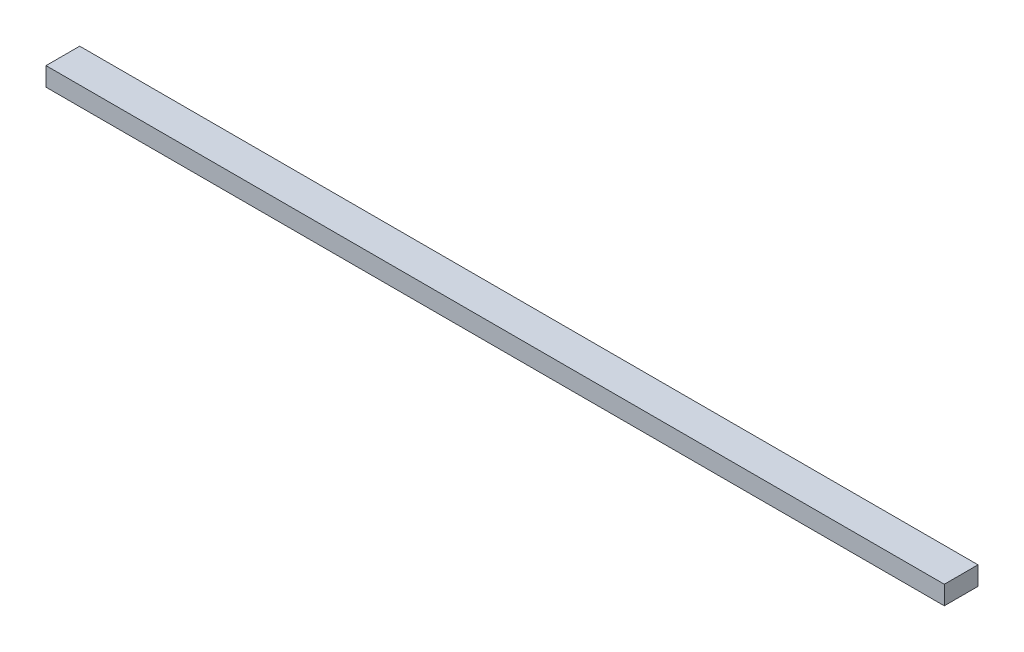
ISO-10303-21;
HEADER;
FILE_DESCRIPTION(('STEP AP214'),'2;1');
FILE_NAME('part.step','',(''),(''),'','','');
FILE_SCHEMA(('AUTOMOTIVE_DESIGN { 1 0 10303 214 1 1 1 1 }'));
ENDSEC;
DATA;
#1=APPLICATION_CONTEXT('core data for automotive mechanical design processes');
#2=APPLICATION_PROTOCOL_DEFINITION('international standard','automotive_design',2000,#1);
#3=PRODUCT_CONTEXT('',#1,'mechanical');
#4=PRODUCT('Part','Part','',(#3));
#5=PRODUCT_RELATED_PRODUCT_CATEGORY('part','',(#4));
#6=PRODUCT_DEFINITION_FORMATION('','',#4);
#7=PRODUCT_DEFINITION_CONTEXT('part definition',#1,'design');
#8=PRODUCT_DEFINITION('design','',#6,#7);
#9=PRODUCT_DEFINITION_SHAPE('','',#8);
#10=(LENGTH_UNIT() NAMED_UNIT(*) SI_UNIT(.MILLI.,.METRE.));
#11=(NAMED_UNIT(*) PLANE_ANGLE_UNIT() SI_UNIT($,.RADIAN.));
#12=(NAMED_UNIT(*) SI_UNIT($,.STERADIAN.) SOLID_ANGLE_UNIT());
#13=UNCERTAINTY_MEASURE_WITH_UNIT(LENGTH_MEASURE(1.E-05),#10,'distance_accuracy_value','');
#14=(GEOMETRIC_REPRESENTATION_CONTEXT(3) GLOBAL_UNCERTAINTY_ASSIGNED_CONTEXT((#13)) GLOBAL_UNIT_ASSIGNED_CONTEXT((#10,
#11,#12)) REPRESENTATION_CONTEXT('',''));
#15=CARTESIAN_POINT('',(0.,0.,0.));
#16=DIRECTION('',(0.,0.,1.));
#17=DIRECTION('',(1.,0.,0.));
#18=AXIS2_PLACEMENT_3D('',#15,#16,#17);
#19=CARTESIAN_POINT('',(304.8,12.7,11.43));
#20=DIRECTION('',(-1.,0.,0.));
#21=DIRECTION('',(0.,0.,1.));
#22=AXIS2_PLACEMENT_3D('',#19,#20,#21);
#23=PLANE('',#22);
#24=DIRECTION('',(0.,0.,-1.));
#25=VECTOR('',#24,1.);
#26=CARTESIAN_POINT('',(304.8,0.,11.43));
#27=LINE('',#26,#25);
#28=CARTESIAN_POINT('',(304.8,0.,11.43));
#29=VERTEX_POINT('',#28);
#30=CARTESIAN_POINT('',(304.8,0.,-11.43));
#31=VERTEX_POINT('',#30);
#32=EDGE_CURVE('E96',#29,#31,#27,.T.);
#33=ORIENTED_EDGE('',*,*,#32,.T.);
#34=DIRECTION('',(0.,-1.,0.));
#35=VECTOR('',#34,1.);
#36=CARTESIAN_POINT('',(304.8,12.7,-11.43));
#37=LINE('',#36,#35);
#38=CARTESIAN_POINT('',(304.8,12.7,-11.43));
#39=VERTEX_POINT('',#38);
#40=EDGE_CURVE('E11',#39,#31,#37,.T.);
#41=ORIENTED_EDGE('',*,*,#40,.F.);
#42=DIRECTION('',(0.,0.,-1.));
#43=VECTOR('',#42,1.);
#44=CARTESIAN_POINT('',(304.8,12.7,11.43));
#45=LINE('',#44,#43);
#46=CARTESIAN_POINT('',(304.8,12.7,11.43));
#47=VERTEX_POINT('',#46);
#48=EDGE_CURVE('E84',#47,#39,#45,.T.);
#49=ORIENTED_EDGE('',*,*,#48,.F.);
#50=DIRECTION('',(0.,-1.,0.));
#51=VECTOR('',#50,1.);
#52=CARTESIAN_POINT('',(304.8,12.7,11.43));
#53=LINE('',#52,#51);
#54=EDGE_CURVE('E92',#47,#29,#53,.T.);
#55=ORIENTED_EDGE('',*,*,#54,.T.);
#56=EDGE_LOOP('',(#33,#41,#49,#55));
#57=FACE_BOUND('',#56,.T.);
#58=ADVANCED_FACE('F33',(#57),#23,.F.);
#59=CARTESIAN_POINT('',(-304.8,12.7,-11.43));
#60=DIRECTION('',(0.,0.,1.));
#61=DIRECTION('',(1.,0.,0.));
#62=AXIS2_PLACEMENT_3D('',#59,#60,#61);
#63=PLANE('',#62);
#64=DIRECTION('',(-1.,0.,0.));
#65=VECTOR('',#64,1.);
#66=CARTESIAN_POINT('',(-304.8,0.,-11.43));
#67=LINE('',#66,#65);
#68=CARTESIAN_POINT('',(-304.8,0.,-11.43));
#69=VERTEX_POINT('',#68);
#70=EDGE_CURVE('E88',#31,#69,#67,.T.);
#71=ORIENTED_EDGE('',*,*,#70,.T.);
#72=DIRECTION('',(0.,-1.,0.));
#73=VECTOR('',#72,1.);
#74=CARTESIAN_POINT('',(-304.8,12.7,-11.43));
#75=LINE('',#74,#73);
#76=CARTESIAN_POINT('',(-304.8,12.7,-11.43));
#77=VERTEX_POINT('',#76);
#78=EDGE_CURVE('E41',#77,#69,#75,.T.);
#79=ORIENTED_EDGE('',*,*,#78,.F.);
#80=DIRECTION('',(-1.,0.,0.));
#81=VECTOR('',#80,1.);
#82=CARTESIAN_POINT('',(-304.8,12.7,-11.43));
#83=LINE('',#82,#81);
#84=EDGE_CURVE('E79',#39,#77,#83,.T.);
#85=ORIENTED_EDGE('',*,*,#84,.F.);
#86=ORIENTED_EDGE('',*,*,#40,.T.);
#87=EDGE_LOOP('',(#71,#79,#85,#86));
#88=FACE_BOUND('',#87,.T.);
#89=ADVANCED_FACE('F87',(#88),#63,.F.);
#90=CARTESIAN_POINT('',(-304.8,12.7,11.43));
#91=DIRECTION('',(1.,0.,0.));
#92=DIRECTION('',(0.,0.,-1.));
#93=AXIS2_PLACEMENT_3D('',#90,#91,#92);
#94=PLANE('',#93);
#95=DIRECTION('',(0.,0.,1.));
#96=VECTOR('',#95,1.);
#97=CARTESIAN_POINT('',(-304.8,0.,11.43));
#98=LINE('',#97,#96);
#99=CARTESIAN_POINT('',(-304.8,0.,11.43));
#100=VERTEX_POINT('',#99);
#101=EDGE_CURVE('E66',#69,#100,#98,.T.);
#102=ORIENTED_EDGE('',*,*,#101,.T.);
#103=DIRECTION('',(0.,-1.,0.));
#104=VECTOR('',#103,1.);
#105=CARTESIAN_POINT('',(-304.8,12.7,11.43));
#106=LINE('',#105,#104);
#107=CARTESIAN_POINT('',(-304.8,12.7,11.43));
#108=VERTEX_POINT('',#107);
#109=EDGE_CURVE('E89',#108,#100,#106,.T.);
#110=ORIENTED_EDGE('',*,*,#109,.F.);
#111=DIRECTION('',(0.,0.,1.));
#112=VECTOR('',#111,1.);
#113=CARTESIAN_POINT('',(-304.8,12.7,11.43));
#114=LINE('',#113,#112);
#115=EDGE_CURVE('E82',#77,#108,#114,.T.);
#116=ORIENTED_EDGE('',*,*,#115,.F.);
#117=ORIENTED_EDGE('',*,*,#78,.T.);
#118=EDGE_LOOP('',(#102,#110,#116,#117));
#119=FACE_BOUND('',#118,.T.);
#120=ADVANCED_FACE('F90',(#119),#94,.F.);
#121=CARTESIAN_POINT('',(-304.8,12.7,11.43));
#122=DIRECTION('',(0.,0.,-1.));
#123=DIRECTION('',(-1.,0.,0.));
#124=AXIS2_PLACEMENT_3D('',#121,#122,#123);
#125=PLANE('',#124);
#126=DIRECTION('',(1.,0.,0.));
#127=VECTOR('',#126,1.);
#128=CARTESIAN_POINT('',(-304.8,0.,11.43));
#129=LINE('',#128,#127);
#130=EDGE_CURVE('E72',#100,#29,#129,.T.);
#131=ORIENTED_EDGE('',*,*,#130,.T.);
#132=ORIENTED_EDGE('',*,*,#54,.F.);
#133=DIRECTION('',(1.,0.,0.));
#134=VECTOR('',#133,1.);
#135=CARTESIAN_POINT('',(-304.8,12.7,11.43));
#136=LINE('',#135,#134);
#137=EDGE_CURVE('E49',#108,#47,#136,.T.);
#138=ORIENTED_EDGE('',*,*,#137,.F.);
#139=ORIENTED_EDGE('',*,*,#109,.T.);
#140=EDGE_LOOP('',(#131,#132,#138,#139));
#141=FACE_BOUND('',#140,.T.);
#142=ADVANCED_FACE('F103',(#141),#125,.F.);
#143=CARTESIAN_POINT('',(0.,12.7,0.));
#144=DIRECTION('',(0.,-1.,0.));
#145=DIRECTION('',(0.,0.,-1.));
#146=AXIS2_PLACEMENT_3D('',#143,#144,#145);
#147=PLANE('',#146);
#148=ORIENTED_EDGE('',*,*,#48,.T.);
#149=ORIENTED_EDGE('',*,*,#84,.T.);
#150=ORIENTED_EDGE('',*,*,#115,.T.);
#151=ORIENTED_EDGE('',*,*,#137,.T.);
#152=EDGE_LOOP('',(#148,#149,#150,#151));
#153=FACE_BOUND('',#152,.T.);
#154=ADVANCED_FACE('F80',(#153),#147,.F.);
#155=CARTESIAN_POINT('',(0.,0.,0.));
#156=DIRECTION('',(0.,-1.,0.));
#157=DIRECTION('',(0.,0.,-1.));
#158=AXIS2_PLACEMENT_3D('',#155,#156,#157);
#159=PLANE('',#158);
#160=ORIENTED_EDGE('',*,*,#32,.F.);
#161=ORIENTED_EDGE('',*,*,#130,.F.);
#162=ORIENTED_EDGE('',*,*,#101,.F.);
#163=ORIENTED_EDGE('',*,*,#70,.F.);
#164=EDGE_LOOP('',(#160,#161,#162,#163));
#165=FACE_BOUND('',#164,.T.);
#166=ADVANCED_FACE('F106',(#165),#159,.T.);
#167=CLOSED_SHELL('',(#58,#89,#120,#142,#154,#166));
#168=MANIFOLD_SOLID_BREP('B2',#167);
#169=ADVANCED_BREP_SHAPE_REPRESENTATION('',(#18,#168),#14);
#170=SHAPE_DEFINITION_REPRESENTATION(#9,#169);
ENDSEC;
END-ISO-10303-21;
